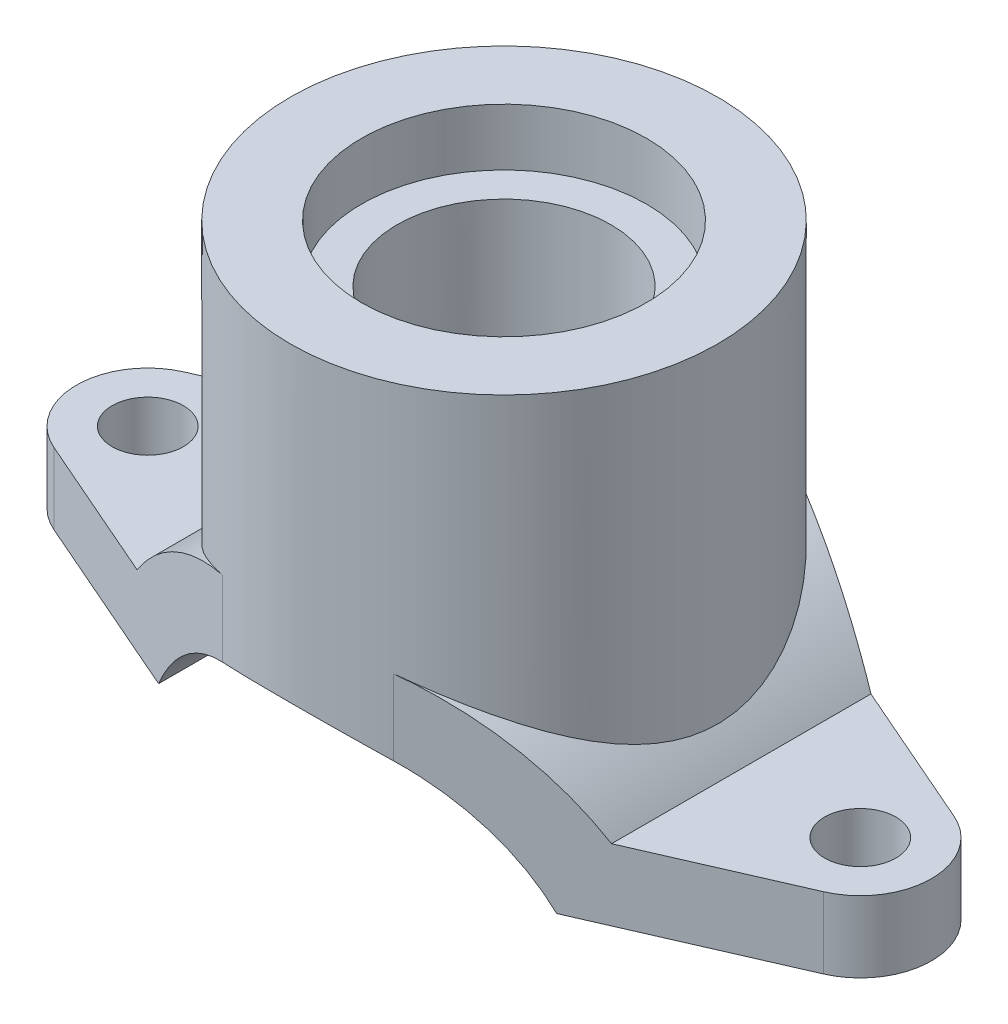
from build123d import *

# Parameters (mm, degrees)
BOSS_EXTRUDE1_DEPTH = 75
SKETCH2_OUTSIDE_W   = 370.368
SKETCH2_OUTSIDE_H   = 220.368
CUT_EXTRUDE1_DEPTH  = 223.162102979
BOSS_EXTRUDE2_REACH = 227
SKETCH3_R           = 75
SKETCH5_R           = 12.5
CUT_EXTRUDE2_DEPTH  = 210.165006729


with BuildPart() as part:
    # Sketch1 → Boss-Extrude1 (new, symmetric)
    with BuildSketch(Plane.XY):
        with BuildLine():
            Line((-150, 0), (-69.84983894, 0))
            ThreePointArc((-69.84983894, 0), (0, 41), (69.84983894, 0))
            Line((69.84983894, 0), (150, 0))
            Line((150, 0), (150, 25))
            Line((150, 25), (83.240615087, 25))
            ThreePointArc((83.240615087, 25), (0, 66), (-83.240615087, 25))
            Line((-83.240615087, 25), (-150, 25))
            Line((-150, 25), (-150, 0))
        make_face()
    extrude(amount=BOSS_EXTRUDE1_DEPTH, both=True)

    # Sketch2 outside → Cut-Extrude1 (cut, through all)
    with BuildSketch(Plane(origin=(0, 66, 75), x_dir=(-1, 0, 0), z_dir=(0, 1, 0))):
        with Locations((0, -75)):
            Rectangle(SKETCH2_OUTSIDE_W, SKETCH2_OUTSIDE_H)
        with BuildLine():
            Line((-135, -97.912878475), (-30, -143.738635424))
            ThreePointArc((-30, -143.738635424), (0, -150), (30, -143.738635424))
            Line((30, -143.738635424), (135, -97.912878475))
            ThreePointArc((135, -97.912878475), (150, -75), (135, -52.087121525))
            Line((135, -52.087121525), (30, -6.261364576))
            ThreePointArc((30, -6.261364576), (0, 0), (-30, -6.261364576))
            Line((-30, -6.261364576), (-135, -52.087121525))
            ThreePointArc((-135, -52.087121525), (-150, -75), (-135, -97.912878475))
        make_face(mode=Mode.SUBTRACT)
    extrude(amount=-CUT_EXTRUDE1_DEPTH, mode=Mode.SUBTRACT)

    # Sketch3 → Boss-Extrude2 (add, up to next)
    with BuildSketch(Plane(origin=(0, 150, 0), x_dir=(1, 0, 0), z_dir=(0, 1, 0)), mode=Mode.PRIVATE) as boss_extrude2_sk1:
        with Locations(Location((0, 0, 0), (0, 0, 113.578178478))):
            Circle(SKETCH3_R)
    boss_extrude2_tool1 = extrude(boss_extrude2_sk1.sketch, amount=-BOSS_EXTRUDE2_REACH, mode=Mode.PRIVATE) - part.part
    add(boss_extrude2_tool1.solids().sort_by_distance((0, 150, 0))[0])

    # Sketch4 → Cut-Revolve1 (revolve, cut)
    with BuildSketch(Plane.XY, mode=Mode.PRIVATE) as cut_revolve1_sk:
        Polygon((0, 150), (50, 150), (50, 130), (37.5, 130), (37.5, 0), (0, 0), align=None)
    revolve(cut_revolve1_sk.sketch.rotate(Axis((0, 0, 0), (0, 1, 0)), 90), axis=Axis((0, 0, 0), (0, 1, 0)), mode=Mode.SUBTRACT)

    # Sketch5 → Cut-Extrude2 (cut, through all)
    with BuildSketch(Plane(origin=(0, 25, 0), x_dir=(1, 0, 0), z_dir=(0, 1, 0))):
        with Locations(Location((-125, 0, 0), (0, 0, 180))):
            Circle(SKETCH5_R)
        with Locations(Location((125, 0, 0), (0, 0, 180))):
            Circle(SKETCH5_R)
    extrude(amount=-CUT_EXTRUDE2_DEPTH, mode=Mode.SUBTRACT)


solid = part.part
